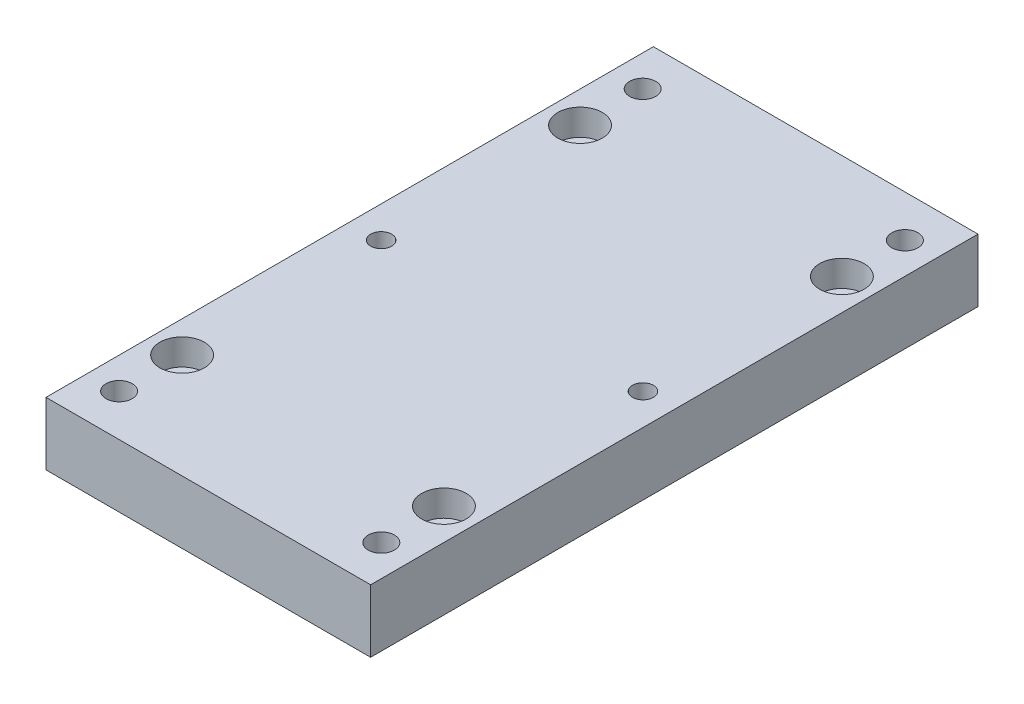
from build123d import *

# Parameters (mm, degrees)
SKETCH1_W                                         = 98.425
SKETCH1_H                                         = 184.15
BOSS_EXTRUDE1_DEPTH                               = 19.05
CBORE_FOR_5_16_SOCKET_HEAD_CAP_SCREW1_D           = 8.4328
CBORE_FOR_5_16_SOCKET_HEAD_CAP_SCREW1_CBORE_D     = 13.49502
CBORE_FOR_5_16_SOCKET_HEAD_CAP_SCREW1_CBORE_DEPTH = 7.9375
F_1_4_0_2500_DOWEL_HOLE1_D                        = 6.35
F_3_8_16_TAPPED_HOLE1_D                           = 7.9375


with BuildPart() as part:
    # Sketch1 → Boss-Extrude1 (new body)
    with BuildSketch(Plane(origin=(0, 0, 0), x_dir=(1, 0, 0), z_dir=(0, 1, 0))):
        Rectangle(SKETCH1_W, SKETCH1_H)
    extrude(amount=BOSS_EXTRUDE1_DEPTH)

    # CBORE for 5_16 Socket Head Cap Screw1 (through all)
    with Locations(Plane(origin=(0, 19.05, 0), x_dir=(1, 0, 0), z_dir=(0, 1, 0))):
        with Locations((-39.6875, 60.325), (-39.6875, -60.325), (39.6875, 60.325), (39.6875, -60.325)):
            CounterBoreHole(CBORE_FOR_5_16_SOCKET_HEAD_CAP_SCREW1_D / 2, CBORE_FOR_5_16_SOCKET_HEAD_CAP_SCREW1_CBORE_D / 2, CBORE_FOR_5_16_SOCKET_HEAD_CAP_SCREW1_CBORE_DEPTH)

    # 1_4 _0.2500_ Dowel Hole1 (through all)
    with Locations(Plane(origin=(0, 0, 0), x_dir=(-1, 0, 0), z_dir=(0, -1, 0))):
        with Locations((-39.7002, 0), (39.6748, 0)):
            Hole(F_1_4_0_2500_DOWEL_HOLE1_D / 2)

    # 3_8-16 Tapped Hole1 (through all)
    with Locations(Plane(origin=(0, 19.05, 0), x_dir=(1, 0, 0), z_dir=(0, 1, 0))):
        with Locations((-39.751, 79.375), (39.751, 79.375), (-39.751, -79.375), (39.751, -79.375)):
            Hole(F_3_8_16_TAPPED_HOLE1_D / 2)


solid = part.part
